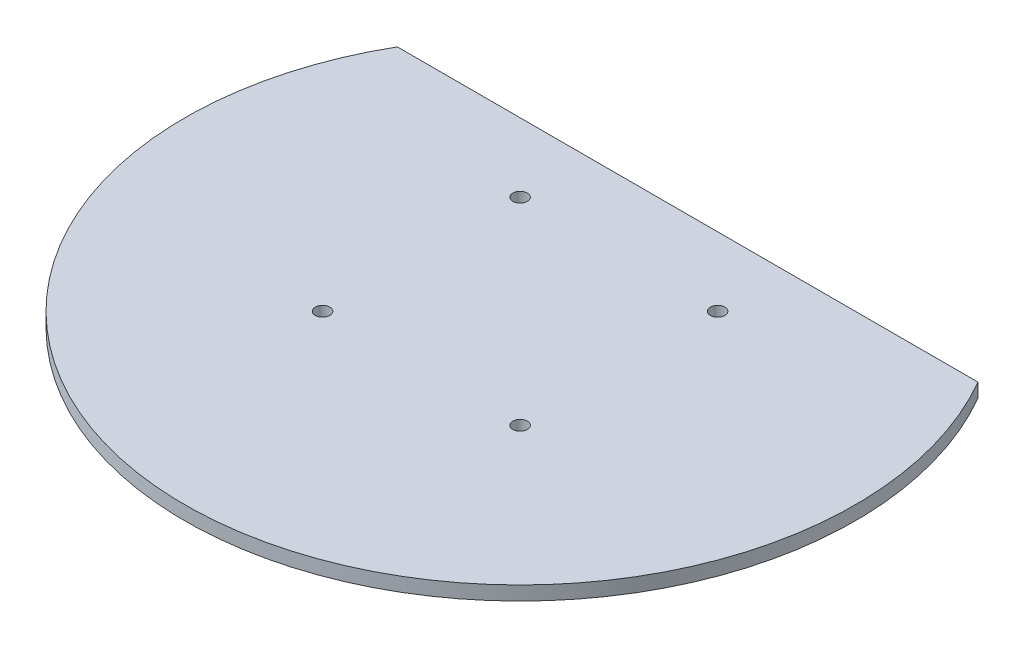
from build123d import *

# Parameters (mm, degrees)
EXTRUDE1_DEPTH = 6.35
SKETCH2_R      = 3.302
EXTRUDE2_DEPTH = 6.35


with BuildPart() as part:
    # Sketch1 → Extrude1 (new body)
    with BuildSketch(Plane(origin=(0, 0, 0), x_dir=(1, 0, 0), z_dir=(0, 1, 0))):
        with BuildLine():
            Line((-131.982271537, 76.2), (131.982271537, 76.2))
            ThreePointArc((131.982271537, 76.2), (0, -152.4), (-131.982271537, 76.2))
        make_face()
    extrude(amount=EXTRUDE1_DEPTH)

    # Sketch2 → Extrude2 (cut)
    with BuildSketch(Plane(origin=(0, 6.35, 0), x_dir=(1, 0, 0), z_dir=(0, 1, 0))):
        with Locations((-44.901280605, 44.901280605)):
            Circle(SKETCH2_R)
        with Locations((44.901280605, 44.901280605)):
            Circle(SKETCH2_R)
        with Locations((44.901280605, -44.901280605)):
            Circle(SKETCH2_R)
        with Locations((-44.901280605, -44.901280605)):
            Circle(SKETCH2_R)
    extrude(amount=-EXTRUDE2_DEPTH, mode=Mode.SUBTRACT)


solid = part.part
